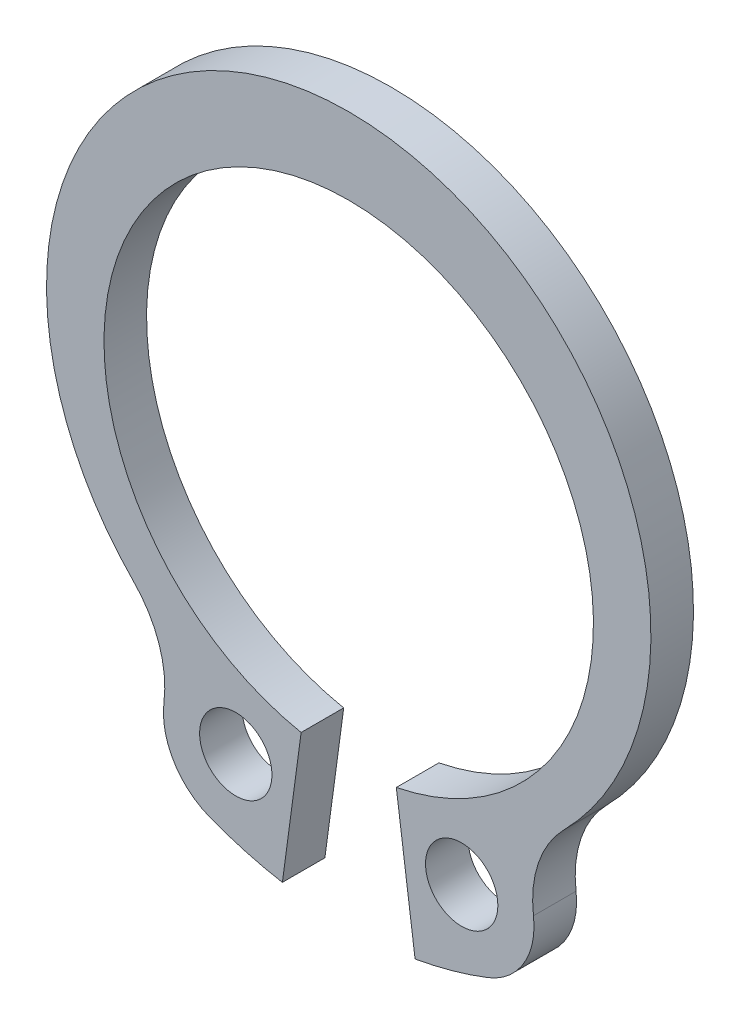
from build123d import *

# Parameters (mm, degrees)
ESQUISSE1_R          = 0.85
BASE_EXTRUSION_DEPTH = 1


with BuildPart() as part:
    # Esquisse1 → Base-Extrusion (new body)
    with BuildSketch(Plane.XY):
        with BuildLine():
            Line((1.118439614, -5.640176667), (1.558995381, -8.910636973))
            ThreePointArc((1.558995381, -8.910636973), (2.425079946, -8.714866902), (3.26779895, -8.435129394))
            ThreePointArc((3.26779895, -8.435129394), (4.112877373, -7.722143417), (4.340699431, -6.640199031))
            ThreePointArc((4.340699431, -6.640199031), (4.456633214, -5.50568373), (5.055508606, -4.535161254))
            ThreePointArc((5.055508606, -4.535161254), (0, 7.55), (-5.055508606, -4.535161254))
            ThreePointArc((-5.055508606, -4.535161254), (-4.456633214, -5.50568373), (-4.340699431, -6.640199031))
            ThreePointArc((-4.340699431, -6.640199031), (-4.112877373, -7.722143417), (-3.26779895, -8.435129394))
            ThreePointArc((-3.26779895, -8.435129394), (-2.425079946, -8.714866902), (-1.558995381, -8.910636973))
            Line((-1.558995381, -8.910636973), (-1.118439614, -5.640176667))
            ThreePointArc((-1.118439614, -5.640176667), (0, 5.75), (1.118439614, -5.640176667))
        make_face()
        with Locations((2.653686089, -6.849927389)):
            Circle(ESQUISSE1_R, mode=Mode.SUBTRACT)
        with Locations(Location((-2.653686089, -6.849927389, 0), (0, 0, 180))):
            Circle(ESQUISSE1_R, mode=Mode.SUBTRACT)
    extrude(amount=BASE_EXTRUSION_DEPTH)


solid = part.part
